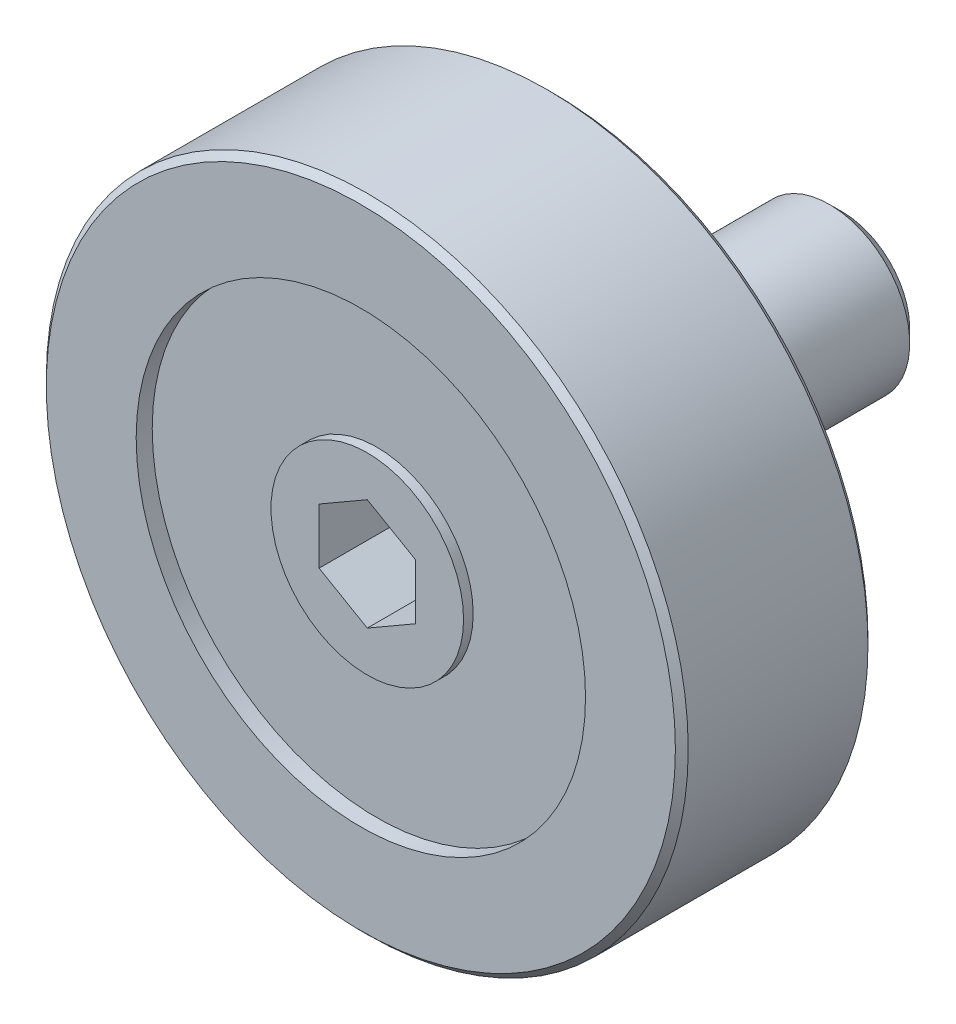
ISO-10303-21;
HEADER;
FILE_DESCRIPTION(('STEP AP214'),'2;1');
FILE_NAME('part.step','',(''),(''),'','','');
FILE_SCHEMA(('AUTOMOTIVE_DESIGN { 1 0 10303 214 1 1 1 1 }'));
ENDSEC;
DATA;
#1=APPLICATION_CONTEXT('core data for automotive mechanical design processes');
#2=APPLICATION_PROTOCOL_DEFINITION('international standard','automotive_design',2000,#1);
#3=PRODUCT_CONTEXT('',#1,'mechanical');
#4=PRODUCT('Part','Part','',(#3));
#5=PRODUCT_RELATED_PRODUCT_CATEGORY('part','',(#4));
#6=PRODUCT_DEFINITION_FORMATION('','',#4);
#7=PRODUCT_DEFINITION_CONTEXT('part definition',#1,'design');
#8=PRODUCT_DEFINITION('design','',#6,#7);
#9=PRODUCT_DEFINITION_SHAPE('','',#8);
#10=(LENGTH_UNIT() NAMED_UNIT(*) SI_UNIT(.MILLI.,.METRE.));
#11=(NAMED_UNIT(*) PLANE_ANGLE_UNIT() SI_UNIT($,.RADIAN.));
#12=(NAMED_UNIT(*) SI_UNIT($,.STERADIAN.) SOLID_ANGLE_UNIT());
#13=UNCERTAINTY_MEASURE_WITH_UNIT(LENGTH_MEASURE(1.E-05),#10,'distance_accuracy_value','');
#14=(GEOMETRIC_REPRESENTATION_CONTEXT(3) GLOBAL_UNCERTAINTY_ASSIGNED_CONTEXT((#13)) GLOBAL_UNIT_ASSIGNED_CONTEXT((#10,
#11,#12)) REPRESENTATION_CONTEXT('',''));
#15=CARTESIAN_POINT('',(0.,0.,0.));
#16=DIRECTION('',(0.,0.,1.));
#17=DIRECTION('',(1.,0.,0.));
#18=AXIS2_PLACEMENT_3D('',#15,#16,#17);
#19=CARTESIAN_POINT('',(0.,4.00000000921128,-5.82734880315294E-09));
#20=DIRECTION('',(0.,0.,1.));
#21=DIRECTION('',(1.,0.,0.));
#22=AXIS2_PLACEMENT_3D('',#19,#20,#21);
#23=PLANE('',#22);
#24=CARTESIAN_POINT('',(0.,9.21126900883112E-09,-5.82734901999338E-09));
#25=DIRECTION('',(0.,0.,1.));
#26=DIRECTION('',(1.,0.,0.));
#27=AXIS2_PLACEMENT_3D('',#24,#25,#26);
#28=CIRCLE('',#27,4.);
#29=CARTESIAN_POINT('',(4.,9.21126900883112E-09,-5.82734901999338E-09));
#30=VERTEX_POINT('',#29);
#31=EDGE_CURVE('E9',#30,#30,#28,.T.);
#32=ORIENTED_EDGE('',*,*,#31,.F.);
#33=EDGE_LOOP('',(#32));
#34=FACE_BOUND('',#33,.T.);
#35=CARTESIAN_POINT('',(0.,9.21126900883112E-09,-5.82734901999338E-09));
#36=DIRECTION('',(0.,0.,-1.));
#37=DIRECTION('',(-1.,0.,0.));
#38=AXIS2_PLACEMENT_3D('',#35,#36,#37);
#39=CIRCLE('',#38,2.);
#40=CARTESIAN_POINT('',(-2.,9.21126900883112E-09,-5.82734901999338E-09));
#41=VERTEX_POINT('',#40);
#42=EDGE_CURVE('E104',#41,#41,#39,.T.);
#43=ORIENTED_EDGE('',*,*,#42,.F.);
#44=EDGE_LOOP('',(#43));
#45=FACE_BOUND('',#44,.T.);
#46=ADVANCED_FACE('F14',(#34,#45),#23,.F.);
#47=CARTESIAN_POINT('',(0.,9.21126900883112E-09,9.99999999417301));
#48=DIRECTION('',(0.,0.,1.));
#49=DIRECTION('',(1.,0.,0.));
#50=AXIS2_PLACEMENT_3D('',#47,#48,#49);
#51=CYLINDRICAL_SURFACE('',#50,4.);
#52=CARTESIAN_POINT('',(0.,9.21126900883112E-09,1.49999999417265));
#53=DIRECTION('',(0.,0.,1.));
#54=DIRECTION('',(1.,0.,0.));
#55=AXIS2_PLACEMENT_3D('',#52,#53,#54);
#56=CIRCLE('',#55,4.);
#57=CARTESIAN_POINT('',(4.,9.21126900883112E-09,1.49999999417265));
#58=VERTEX_POINT('',#57);
#59=EDGE_CURVE('E22',#58,#58,#56,.T.);
#60=ORIENTED_EDGE('',*,*,#59,.F.);
#61=EDGE_LOOP('',(#60));
#62=FACE_BOUND('',#61,.T.);
#63=ORIENTED_EDGE('',*,*,#31,.T.);
#64=EDGE_LOOP('',(#63));
#65=FACE_BOUND('',#64,.T.);
#66=ADVANCED_FACE('F156',(#62,#65),#51,.T.);
#67=CARTESIAN_POINT('',(0.,4.00000000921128,1.49999999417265));
#68=DIRECTION('',(0.,0.,1.));
#69=DIRECTION('',(1.,0.,0.));
#70=AXIS2_PLACEMENT_3D('',#67,#68,#69);
#71=PLANE('',#70);
#72=CARTESIAN_POINT('',(0.,9.21126900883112E-09,1.49999999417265));
#73=DIRECTION('',(0.,0.,1.));
#74=DIRECTION('',(1.,0.,0.));
#75=AXIS2_PLACEMENT_3D('',#72,#73,#74);
#76=CIRCLE('',#75,6.99999999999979);
#77=CARTESIAN_POINT('',(6.99999999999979,9.21126900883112E-09,1.49999999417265));
#78=VERTEX_POINT('',#77);
#79=EDGE_CURVE('E149',#78,#78,#76,.T.);
#80=ORIENTED_EDGE('',*,*,#79,.F.);
#81=EDGE_LOOP('',(#80));
#82=FACE_BOUND('',#81,.T.);
#83=ORIENTED_EDGE('',*,*,#59,.T.);
#84=EDGE_LOOP('',(#83));
#85=FACE_BOUND('',#84,.T.);
#86=ADVANCED_FACE('F154',(#82,#85),#71,.F.);
#87=CARTESIAN_POINT('',(0.,9.21126900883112E-09,9.99999999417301));
#88=DIRECTION('',(0.,0.,1.));
#89=DIRECTION('',(1.,0.,0.));
#90=AXIS2_PLACEMENT_3D('',#87,#88,#89);
#91=CYLINDRICAL_SURFACE('',#90,6.99999999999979);
#92=CARTESIAN_POINT('',(0.,9.21126900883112E-09,0.999999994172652));
#93=DIRECTION('',(0.,0.,1.));
#94=DIRECTION('',(1.,0.,0.));
#95=AXIS2_PLACEMENT_3D('',#92,#93,#94);
#96=CIRCLE('',#95,6.99999999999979);
#97=CARTESIAN_POINT('',(6.99999999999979,9.21126900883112E-09,0.999999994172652));
#98=VERTEX_POINT('',#97);
#99=EDGE_CURVE('E146',#98,#98,#96,.T.);
#100=ORIENTED_EDGE('',*,*,#99,.F.);
#101=EDGE_LOOP('',(#100));
#102=FACE_BOUND('',#101,.T.);
#103=ORIENTED_EDGE('',*,*,#79,.T.);
#104=EDGE_LOOP('',(#103));
#105=FACE_BOUND('',#104,.T.);
#106=ADVANCED_FACE('F237',(#102,#105),#91,.F.);
#107=CARTESIAN_POINT('',(0.,9.80000000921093,0.999999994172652));
#108=DIRECTION('',(0.,0.,1.));
#109=DIRECTION('',(1.,0.,0.));
#110=AXIS2_PLACEMENT_3D('',#107,#108,#109);
#111=PLANE('',#110);
#112=CARTESIAN_POINT('',(0.,9.21126900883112E-09,0.999999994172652));
#113=DIRECTION('',(0.,0.,1.));
#114=DIRECTION('',(1.,0.,0.));
#115=AXIS2_PLACEMENT_3D('',#112,#113,#114);
#116=CIRCLE('',#115,9.79999999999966);
#117=CARTESIAN_POINT('',(9.79999999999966,9.21126900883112E-09,0.999999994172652));
#118=VERTEX_POINT('',#117);
#119=EDGE_CURVE('E143',#118,#118,#116,.T.);
#120=ORIENTED_EDGE('',*,*,#119,.F.);
#121=EDGE_LOOP('',(#120));
#122=FACE_BOUND('',#121,.T.);
#123=ORIENTED_EDGE('',*,*,#99,.T.);
#124=EDGE_LOOP('',(#123));
#125=FACE_BOUND('',#124,.T.);
#126=ADVANCED_FACE('F233',(#122,#125),#111,.F.);
#127=CARTESIAN_POINT('',(0.,9.21126900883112E-09,0.999999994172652));
#128=DIRECTION('',(0.,0.,1.));
#129=DIRECTION('',(1.,0.,0.));
#130=AXIS2_PLACEMENT_3D('',#127,#128,#129);
#131=CONICAL_SURFACE('',#130,9.79999999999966,0.785398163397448);
#132=CARTESIAN_POINT('',(0.,9.21126900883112E-09,1.19999999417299));
#133=DIRECTION('',(0.,0.,1.));
#134=DIRECTION('',(1.,0.,0.));
#135=AXIS2_PLACEMENT_3D('',#132,#133,#134);
#136=CIRCLE('',#135,10.);
#137=CARTESIAN_POINT('',(10.,9.21126900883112E-09,1.19999999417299));
#138=VERTEX_POINT('',#137);
#139=EDGE_CURVE('E140',#138,#138,#136,.T.);
#140=ORIENTED_EDGE('',*,*,#139,.F.);
#141=EDGE_LOOP('',(#140));
#142=FACE_BOUND('',#141,.T.);
#143=ORIENTED_EDGE('',*,*,#119,.T.);
#144=EDGE_LOOP('',(#143));
#145=FACE_BOUND('',#144,.T.);
#146=ADVANCED_FACE('F229',(#142,#145),#131,.T.);
#147=CARTESIAN_POINT('',(0.,9.21126900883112E-09,9.99999999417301));
#148=DIRECTION('',(0.,0.,1.));
#149=DIRECTION('',(1.,0.,0.));
#150=AXIS2_PLACEMENT_3D('',#147,#148,#149);
#151=CYLINDRICAL_SURFACE('',#150,10.);
#152=CARTESIAN_POINT('',(0.,9.21126900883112E-09,6.79999999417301));
#153=DIRECTION('',(0.,0.,1.));
#154=DIRECTION('',(1.,0.,0.));
#155=AXIS2_PLACEMENT_3D('',#152,#153,#154);
#156=CIRCLE('',#155,10.);
#157=CARTESIAN_POINT('',(10.,9.21126900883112E-09,6.79999999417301));
#158=VERTEX_POINT('',#157);
#159=EDGE_CURVE('E137',#158,#158,#156,.T.);
#160=ORIENTED_EDGE('',*,*,#159,.F.);
#161=EDGE_LOOP('',(#160));
#162=FACE_BOUND('',#161,.T.);
#163=ORIENTED_EDGE('',*,*,#139,.T.);
#164=EDGE_LOOP('',(#163));
#165=FACE_BOUND('',#164,.T.);
#166=ADVANCED_FACE('F225',(#162,#165),#151,.T.);
#167=CARTESIAN_POINT('',(0.,9.21126900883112E-09,6.79999999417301));
#168=DIRECTION('',(0.,0.,-1.));
#169=DIRECTION('',(-1.,0.,0.));
#170=AXIS2_PLACEMENT_3D('',#167,#168,#169);
#171=CONICAL_SURFACE('',#170,10.,0.785398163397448);
#172=CARTESIAN_POINT('',(0.,9.21126900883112E-09,6.999999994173));
#173=DIRECTION('',(0.,0.,1.));
#174=DIRECTION('',(1.,0.,0.));
#175=AXIS2_PLACEMENT_3D('',#172,#173,#174);
#176=CIRCLE('',#175,9.8);
#177=CARTESIAN_POINT('',(9.8,9.21126900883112E-09,6.999999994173));
#178=VERTEX_POINT('',#177);
#179=EDGE_CURVE('E134',#178,#178,#176,.T.);
#180=ORIENTED_EDGE('',*,*,#179,.F.);
#181=EDGE_LOOP('',(#180));
#182=FACE_BOUND('',#181,.T.);
#183=ORIENTED_EDGE('',*,*,#159,.T.);
#184=EDGE_LOOP('',(#183));
#185=FACE_BOUND('',#184,.T.);
#186=ADVANCED_FACE('F221',(#182,#185),#171,.T.);
#187=CARTESIAN_POINT('',(0.,9.80000000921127,6.999999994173));
#188=DIRECTION('',(0.,0.,-1.));
#189=DIRECTION('',(-1.,0.,0.));
#190=AXIS2_PLACEMENT_3D('',#187,#188,#189);
#191=PLANE('',#190);
#192=CARTESIAN_POINT('',(0.,9.21126900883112E-09,6.999999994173));
#193=DIRECTION('',(0.,0.,1.));
#194=DIRECTION('',(1.,0.,0.));
#195=AXIS2_PLACEMENT_3D('',#192,#193,#194);
#196=CIRCLE('',#195,7.);
#197=CARTESIAN_POINT('',(7.,9.21126900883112E-09,6.999999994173));
#198=VERTEX_POINT('',#197);
#199=EDGE_CURVE('E131',#198,#198,#196,.T.);
#200=ORIENTED_EDGE('',*,*,#199,.F.);
#201=EDGE_LOOP('',(#200));
#202=FACE_BOUND('',#201,.T.);
#203=ORIENTED_EDGE('',*,*,#179,.T.);
#204=EDGE_LOOP('',(#203));
#205=FACE_BOUND('',#204,.T.);
#206=ADVANCED_FACE('F217',(#202,#205),#191,.F.);
#207=CARTESIAN_POINT('',(0.,9.21126900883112E-09,9.99999999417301));
#208=DIRECTION('',(0.,0.,1.));
#209=DIRECTION('',(1.,0.,0.));
#210=AXIS2_PLACEMENT_3D('',#207,#208,#209);
#211=CYLINDRICAL_SURFACE('',#210,7.);
#212=CARTESIAN_POINT('',(0.,9.21126900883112E-09,6.499999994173));
#213=DIRECTION('',(0.,0.,1.));
#214=DIRECTION('',(1.,0.,0.));
#215=AXIS2_PLACEMENT_3D('',#212,#213,#214);
#216=CIRCLE('',#215,7.);
#217=CARTESIAN_POINT('',(7.,9.21126900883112E-09,6.499999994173));
#218=VERTEX_POINT('',#217);
#219=EDGE_CURVE('E128',#218,#218,#216,.T.);
#220=ORIENTED_EDGE('',*,*,#219,.F.);
#221=EDGE_LOOP('',(#220));
#222=FACE_BOUND('',#221,.T.);
#223=ORIENTED_EDGE('',*,*,#199,.T.);
#224=EDGE_LOOP('',(#223));
#225=FACE_BOUND('',#224,.T.);
#226=ADVANCED_FACE('F213',(#222,#225),#211,.F.);
#227=CARTESIAN_POINT('',(0.,3.00000000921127,6.499999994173));
#228=DIRECTION('',(0.,0.,-1.));
#229=DIRECTION('',(-1.,0.,0.));
#230=AXIS2_PLACEMENT_3D('',#227,#228,#229);
#231=PLANE('',#230);
#232=CARTESIAN_POINT('',(0.,9.21126900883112E-09,6.499999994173));
#233=DIRECTION('',(0.,0.,1.));
#234=DIRECTION('',(1.,0.,0.));
#235=AXIS2_PLACEMENT_3D('',#232,#233,#234);
#236=CIRCLE('',#235,3.);
#237=CARTESIAN_POINT('',(3.,9.21126900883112E-09,6.499999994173));
#238=VERTEX_POINT('',#237);
#239=EDGE_CURVE('E125',#238,#238,#236,.T.);
#240=ORIENTED_EDGE('',*,*,#239,.F.);
#241=EDGE_LOOP('',(#240));
#242=FACE_BOUND('',#241,.T.);
#243=ORIENTED_EDGE('',*,*,#219,.T.);
#244=EDGE_LOOP('',(#243));
#245=FACE_BOUND('',#244,.T.);
#246=ADVANCED_FACE('F209',(#242,#245),#231,.F.);
#247=CARTESIAN_POINT('',(0.,9.21126900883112E-09,9.99999999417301));
#248=DIRECTION('',(0.,0.,1.));
#249=DIRECTION('',(1.,0.,0.));
#250=AXIS2_PLACEMENT_3D('',#247,#248,#249);
#251=CYLINDRICAL_SURFACE('',#250,3.);
#252=CARTESIAN_POINT('',(0.,9.21126900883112E-09,6.79999999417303));
#253=DIRECTION('',(0.,0.,1.));
#254=DIRECTION('',(1.,0.,0.));
#255=AXIS2_PLACEMENT_3D('',#252,#253,#254);
#256=CIRCLE('',#255,3.);
#257=CARTESIAN_POINT('',(3.,9.21126900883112E-09,6.79999999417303));
#258=VERTEX_POINT('',#257);
#259=EDGE_CURVE('E117',#258,#258,#256,.T.);
#260=ORIENTED_EDGE('',*,*,#259,.F.);
#261=EDGE_LOOP('',(#260));
#262=FACE_BOUND('',#261,.T.);
#263=ORIENTED_EDGE('',*,*,#239,.T.);
#264=EDGE_LOOP('',(#263));
#265=FACE_BOUND('',#264,.T.);
#266=ADVANCED_FACE('F206',(#262,#265),#251,.T.);
#267=CARTESIAN_POINT('',(0.,3.00000000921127,6.79999999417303));
#268=DIRECTION('',(0.,0.,-1.));
#269=DIRECTION('',(-1.,0.,0.));
#270=AXIS2_PLACEMENT_3D('',#267,#268,#269);
#271=PLANE('',#270);
#272=DIRECTION('',(-0.866025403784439,-0.5,0.));
#273=VECTOR('',#272,1.);
#274=CARTESIAN_POINT('',(0.,1.73205080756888,6.79999999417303));
#275=LINE('',#274,#273);
#276=CARTESIAN_POINT('',(0.,1.73205080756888,6.79999999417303));
#277=VERTEX_POINT('',#276);
#278=CARTESIAN_POINT('',(-1.5,0.866025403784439,6.79999999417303));
#279=VERTEX_POINT('',#278);
#280=EDGE_CURVE('E103',#277,#279,#275,.T.);
#281=ORIENTED_EDGE('',*,*,#280,.F.);
#282=DIRECTION('',(-0.866025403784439,0.5,0.));
#283=VECTOR('',#282,1.);
#284=CARTESIAN_POINT('',(1.5,0.866025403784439,6.79999999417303));
#285=LINE('',#284,#283);
#286=CARTESIAN_POINT('',(1.5,0.866025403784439,6.79999999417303));
#287=VERTEX_POINT('',#286);
#288=EDGE_CURVE('E29',#287,#277,#285,.T.);
#289=ORIENTED_EDGE('',*,*,#288,.F.);
#290=DIRECTION('',(0.,1.,0.));
#291=VECTOR('',#290,1.);
#292=CARTESIAN_POINT('',(1.5,-0.866025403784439,6.79999999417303));
#293=LINE('',#292,#291);
#294=CARTESIAN_POINT('',(1.5,-0.866025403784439,6.79999999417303));
#295=VERTEX_POINT('',#294);
#296=EDGE_CURVE('E113',#295,#287,#293,.T.);
#297=ORIENTED_EDGE('',*,*,#296,.F.);
#298=DIRECTION('',(0.866025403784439,0.5,0.));
#299=VECTOR('',#298,1.);
#300=CARTESIAN_POINT('',(0.,-1.73205080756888,6.79999999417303));
#301=LINE('',#300,#299);
#302=CARTESIAN_POINT('',(0.,-1.73205080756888,6.79999999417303));
#303=VERTEX_POINT('',#302);
#304=EDGE_CURVE('E111',#303,#295,#301,.T.);
#305=ORIENTED_EDGE('',*,*,#304,.F.);
#306=DIRECTION('',(0.866025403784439,-0.5,0.));
#307=VECTOR('',#306,1.);
#308=CARTESIAN_POINT('',(-1.5,-0.866025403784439,6.79999999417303));
#309=LINE('',#308,#307);
#310=CARTESIAN_POINT('',(-1.5,-0.866025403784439,6.79999999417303));
#311=VERTEX_POINT('',#310);
#312=EDGE_CURVE('E77',#311,#303,#309,.T.);
#313=ORIENTED_EDGE('',*,*,#312,.F.);
#314=DIRECTION('',(0.,-1.,0.));
#315=VECTOR('',#314,1.);
#316=CARTESIAN_POINT('',(-1.5,0.866025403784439,6.79999999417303));
#317=LINE('',#316,#315);
#318=EDGE_CURVE('E107',#279,#311,#317,.T.);
#319=ORIENTED_EDGE('',*,*,#318,.F.);
#320=EDGE_LOOP('',(#281,#289,#297,#305,#313,#319));
#321=FACE_BOUND('',#320,.T.);
#322=ORIENTED_EDGE('',*,*,#259,.T.);
#323=EDGE_LOOP('',(#322));
#324=FACE_BOUND('',#323,.T.);
#325=ADVANCED_FACE('F181',(#321,#324),#271,.F.);
#326=CARTESIAN_POINT('',(1.5,0.866025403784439,4.29999999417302));
#327=DIRECTION('',(0.5,0.866025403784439,0.));
#328=DIRECTION('',(-0.866025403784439,0.5,0.));
#329=AXIS2_PLACEMENT_3D('',#326,#327,#328);
#330=PLANE('',#329);
#331=ORIENTED_EDGE('',*,*,#288,.T.);
#332=DIRECTION('',(0.,0.,1.));
#333=VECTOR('',#332,1.);
#334=CARTESIAN_POINT('',(0.,1.73205080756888,4.29999999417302));
#335=LINE('',#334,#333);
#336=CARTESIAN_POINT('',(0.,1.73205080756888,4.29999999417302));
#337=VERTEX_POINT('',#336);
#338=EDGE_CURVE('E59',#337,#277,#335,.T.);
#339=ORIENTED_EDGE('',*,*,#338,.F.);
#340=DIRECTION('',(-0.866025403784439,0.5,0.));
#341=VECTOR('',#340,1.);
#342=CARTESIAN_POINT('',(1.5,0.866025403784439,4.29999999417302));
#343=LINE('',#342,#341);
#344=CARTESIAN_POINT('',(1.5,0.866025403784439,4.29999999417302));
#345=VERTEX_POINT('',#344);
#346=EDGE_CURVE('E115',#345,#337,#343,.T.);
#347=ORIENTED_EDGE('',*,*,#346,.F.);
#348=DIRECTION('',(0.,0.,1.));
#349=VECTOR('',#348,1.);
#350=CARTESIAN_POINT('',(1.5,0.866025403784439,4.29999999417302));
#351=LINE('',#350,#349);
#352=EDGE_CURVE('E37',#345,#287,#351,.T.);
#353=ORIENTED_EDGE('',*,*,#352,.T.);
#354=EDGE_LOOP('',(#331,#339,#347,#353));
#355=FACE_BOUND('',#354,.T.);
#356=ADVANCED_FACE('F186',(#355),#330,.F.);
#357=CARTESIAN_POINT('',(1.5,-0.866025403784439,4.29999999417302));
#358=DIRECTION('',(1.,0.,0.));
#359=DIRECTION('',(0.,0.,-1.));
#360=AXIS2_PLACEMENT_3D('',#357,#358,#359);
#361=PLANE('',#360);
#362=ORIENTED_EDGE('',*,*,#296,.T.);
#363=ORIENTED_EDGE('',*,*,#352,.F.);
#364=DIRECTION('',(0.,1.,0.));
#365=VECTOR('',#364,1.);
#366=CARTESIAN_POINT('',(1.5,-0.866025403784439,4.29999999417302));
#367=LINE('',#366,#365);
#368=CARTESIAN_POINT('',(1.5,-0.866025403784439,4.29999999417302));
#369=VERTEX_POINT('',#368);
#370=EDGE_CURVE('E89',#369,#345,#367,.T.);
#371=ORIENTED_EDGE('',*,*,#370,.F.);
#372=DIRECTION('',(0.,0.,1.));
#373=VECTOR('',#372,1.);
#374=CARTESIAN_POINT('',(1.5,-0.866025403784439,4.29999999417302));
#375=LINE('',#374,#373);
#376=EDGE_CURVE('E81',#369,#295,#375,.T.);
#377=ORIENTED_EDGE('',*,*,#376,.T.);
#378=EDGE_LOOP('',(#362,#363,#371,#377));
#379=FACE_BOUND('',#378,.T.);
#380=ADVANCED_FACE('F184',(#379),#361,.F.);
#381=CARTESIAN_POINT('',(0.,-1.73205080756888,4.29999999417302));
#382=DIRECTION('',(0.5,-0.866025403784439,0.));
#383=DIRECTION('',(0.866025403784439,0.5,0.));
#384=AXIS2_PLACEMENT_3D('',#381,#382,#383);
#385=PLANE('',#384);
#386=ORIENTED_EDGE('',*,*,#304,.T.);
#387=ORIENTED_EDGE('',*,*,#376,.F.);
#388=DIRECTION('',(0.866025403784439,0.5,0.));
#389=VECTOR('',#388,1.);
#390=CARTESIAN_POINT('',(0.,-1.73205080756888,4.29999999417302));
#391=LINE('',#390,#389);
#392=CARTESIAN_POINT('',(0.,-1.73205080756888,4.29999999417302));
#393=VERTEX_POINT('',#392);
#394=EDGE_CURVE('E85',#393,#369,#391,.T.);
#395=ORIENTED_EDGE('',*,*,#394,.F.);
#396=DIRECTION('',(0.,0.,1.));
#397=VECTOR('',#396,1.);
#398=CARTESIAN_POINT('',(0.,-1.73205080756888,4.29999999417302));
#399=LINE('',#398,#397);
#400=EDGE_CURVE('E70',#393,#303,#399,.T.);
#401=ORIENTED_EDGE('',*,*,#400,.T.);
#402=EDGE_LOOP('',(#386,#387,#395,#401));
#403=FACE_BOUND('',#402,.T.);
#404=ADVANCED_FACE('F86',(#403),#385,.F.);
#405=CARTESIAN_POINT('',(-1.5,-0.866025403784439,4.29999999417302));
#406=DIRECTION('',(-0.5,-0.866025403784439,0.));
#407=DIRECTION('',(0.866025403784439,-0.5,0.));
#408=AXIS2_PLACEMENT_3D('',#405,#406,#407);
#409=PLANE('',#408);
#410=ORIENTED_EDGE('',*,*,#312,.T.);
#411=ORIENTED_EDGE('',*,*,#400,.F.);
#412=DIRECTION('',(0.866025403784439,-0.5,0.));
#413=VECTOR('',#412,1.);
#414=CARTESIAN_POINT('',(-1.5,-0.866025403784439,4.29999999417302));
#415=LINE('',#414,#413);
#416=CARTESIAN_POINT('',(-1.5,-0.866025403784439,4.29999999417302));
#417=VERTEX_POINT('',#416);
#418=EDGE_CURVE('E74',#417,#393,#415,.T.);
#419=ORIENTED_EDGE('',*,*,#418,.F.);
#420=DIRECTION('',(0.,0.,1.));
#421=VECTOR('',#420,1.);
#422=CARTESIAN_POINT('',(-1.5,-0.866025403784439,4.29999999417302));
#423=LINE('',#422,#421);
#424=EDGE_CURVE('E82',#417,#311,#423,.T.);
#425=ORIENTED_EDGE('',*,*,#424,.T.);
#426=EDGE_LOOP('',(#410,#411,#419,#425));
#427=FACE_BOUND('',#426,.T.);
#428=ADVANCED_FACE('F72',(#427),#409,.F.);
#429=CARTESIAN_POINT('',(-1.5,0.866025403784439,4.29999999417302));
#430=DIRECTION('',(-1.,0.,0.));
#431=DIRECTION('',(0.,-1.,0.));
#432=AXIS2_PLACEMENT_3D('',#429,#430,#431);
#433=PLANE('',#432);
#434=ORIENTED_EDGE('',*,*,#318,.T.);
#435=ORIENTED_EDGE('',*,*,#424,.F.);
#436=DIRECTION('',(0.,-1.,0.));
#437=VECTOR('',#436,1.);
#438=CARTESIAN_POINT('',(-1.5,0.866025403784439,4.29999999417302));
#439=LINE('',#438,#437);
#440=CARTESIAN_POINT('',(-1.5,0.866025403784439,4.29999999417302));
#441=VERTEX_POINT('',#440);
#442=EDGE_CURVE('E95',#441,#417,#439,.T.);
#443=ORIENTED_EDGE('',*,*,#442,.F.);
#444=DIRECTION('',(0.,0.,1.));
#445=VECTOR('',#444,1.);
#446=CARTESIAN_POINT('',(-1.5,0.866025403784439,4.29999999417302));
#447=LINE('',#446,#445);
#448=EDGE_CURVE('E120',#441,#279,#447,.T.);
#449=ORIENTED_EDGE('',*,*,#448,.T.);
#450=EDGE_LOOP('',(#434,#435,#443,#449));
#451=FACE_BOUND('',#450,.T.);
#452=ADVANCED_FACE('F179',(#451),#433,.F.);
#453=CARTESIAN_POINT('',(0.,1.73205080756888,4.29999999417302));
#454=DIRECTION('',(-0.5,0.866025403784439,0.));
#455=DIRECTION('',(-0.866025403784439,-0.5,0.));
#456=AXIS2_PLACEMENT_3D('',#453,#454,#455);
#457=PLANE('',#456);
#458=ORIENTED_EDGE('',*,*,#280,.T.);
#459=ORIENTED_EDGE('',*,*,#448,.F.);
#460=DIRECTION('',(-0.866025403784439,-0.5,0.));
#461=VECTOR('',#460,1.);
#462=CARTESIAN_POINT('',(0.,1.73205080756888,4.29999999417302));
#463=LINE('',#462,#461);
#464=EDGE_CURVE('E97',#337,#441,#463,.T.);
#465=ORIENTED_EDGE('',*,*,#464,.F.);
#466=ORIENTED_EDGE('',*,*,#338,.T.);
#467=EDGE_LOOP('',(#458,#459,#465,#466));
#468=FACE_BOUND('',#467,.T.);
#469=ADVANCED_FACE('F175',(#468),#457,.F.);
#470=CARTESIAN_POINT('',(0.,0.,4.29999999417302));
#471=DIRECTION('',(0.,0.,1.));
#472=DIRECTION('',(1.,0.,0.));
#473=AXIS2_PLACEMENT_3D('',#470,#471,#472);
#474=PLANE('',#473);
#475=ORIENTED_EDGE('',*,*,#346,.T.);
#476=ORIENTED_EDGE('',*,*,#464,.T.);
#477=ORIENTED_EDGE('',*,*,#442,.T.);
#478=ORIENTED_EDGE('',*,*,#418,.T.);
#479=ORIENTED_EDGE('',*,*,#394,.T.);
#480=ORIENTED_EDGE('',*,*,#370,.T.);
#481=EDGE_LOOP('',(#475,#476,#477,#478,#479,#480));
#482=FACE_BOUND('',#481,.T.);
#483=ADVANCED_FACE('F92',(#482),#474,.T.);
#484=CARTESIAN_POINT('',(0.,9.21126900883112E-09,-8.00000000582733));
#485=DIRECTION('',(0.,0.,-1.));
#486=DIRECTION('',(-1.,0.,0.));
#487=AXIS2_PLACEMENT_3D('',#484,#485,#486);
#488=CYLINDRICAL_SURFACE('',#487,2.);
#489=CARTESIAN_POINT('',(0.,9.21126900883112E-09,-1.60000000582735));
#490=DIRECTION('',(0.,0.,-1.));
#491=DIRECTION('',(-1.,0.,0.));
#492=AXIS2_PLACEMENT_3D('',#489,#490,#491);
#493=CIRCLE('',#492,2.);
#494=CARTESIAN_POINT('',(-2.,9.21126900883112E-09,-1.60000000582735));
#495=VERTEX_POINT('',#494);
#496=EDGE_CURVE('E167',#495,#495,#493,.T.);
#497=ORIENTED_EDGE('',*,*,#496,.F.);
#498=EDGE_LOOP('',(#497));
#499=FACE_BOUND('',#498,.T.);
#500=ORIENTED_EDGE('',*,*,#42,.T.);
#501=EDGE_LOOP('',(#500));
#502=FACE_BOUND('',#501,.T.);
#503=ADVANCED_FACE('F349',(#499,#502),#488,.T.);
#504=CARTESIAN_POINT('',(0.,2.00000000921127,-1.60000000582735));
#505=DIRECTION('',(0.,0.,-1.));
#506=DIRECTION('',(-1.,0.,0.));
#507=AXIS2_PLACEMENT_3D('',#504,#505,#506);
#508=PLANE('',#507);
#509=CARTESIAN_POINT('',(0.,9.21126900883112E-09,-1.60000000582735));
#510=DIRECTION('',(0.,0.,-1.));
#511=DIRECTION('',(-1.,0.,0.));
#512=AXIS2_PLACEMENT_3D('',#509,#510,#511);
#513=CIRCLE('',#512,2.5);
#514=CARTESIAN_POINT('',(-2.5,9.21126900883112E-09,-1.60000000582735));
#515=VERTEX_POINT('',#514);
#516=EDGE_CURVE('E170',#515,#515,#513,.T.);
#517=ORIENTED_EDGE('',*,*,#516,.F.);
#518=EDGE_LOOP('',(#517));
#519=FACE_BOUND('',#518,.T.);
#520=ORIENTED_EDGE('',*,*,#496,.T.);
#521=EDGE_LOOP('',(#520));
#522=FACE_BOUND('',#521,.T.);
#523=ADVANCED_FACE('F358',(#519,#522),#508,.F.);
#524=CARTESIAN_POINT('',(0.,9.21126900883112E-09,-8.00000000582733));
#525=DIRECTION('',(0.,0.,-1.));
#526=DIRECTION('',(-1.,0.,0.));
#527=AXIS2_PLACEMENT_3D('',#524,#525,#526);
#528=CYLINDRICAL_SURFACE('',#527,2.5);
#529=CARTESIAN_POINT('',(0.,9.21126900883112E-09,-7.60000000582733));
#530=DIRECTION('',(0.,0.,-1.));
#531=DIRECTION('',(-1.,0.,0.));
#532=AXIS2_PLACEMENT_3D('',#529,#530,#531);
#533=CIRCLE('',#532,2.5);
#534=CARTESIAN_POINT('',(-2.5,9.21126900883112E-09,-7.60000000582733));
#535=VERTEX_POINT('',#534);
#536=EDGE_CURVE('E402',#535,#535,#533,.T.);
#537=ORIENTED_EDGE('',*,*,#536,.F.);
#538=EDGE_LOOP('',(#537));
#539=FACE_BOUND('',#538,.T.);
#540=ORIENTED_EDGE('',*,*,#516,.T.);
#541=EDGE_LOOP('',(#540));
#542=FACE_BOUND('',#541,.T.);
#543=ADVANCED_FACE('F367',(#539,#542),#528,.T.);
#544=CARTESIAN_POINT('',(0.,9.21126900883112E-09,-7.60000000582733));
#545=DIRECTION('',(0.,0.,1.));
#546=DIRECTION('',(1.,0.,0.));
#547=AXIS2_PLACEMENT_3D('',#544,#545,#546);
#548=CONICAL_SURFACE('',#547,2.5,0.785398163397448);
#549=CARTESIAN_POINT('',(0.,9.21126900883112E-09,-8.00000000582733));
#550=DIRECTION('',(0.,0.,-1.));
#551=DIRECTION('',(-1.,0.,0.));
#552=AXIS2_PLACEMENT_3D('',#549,#550,#551);
#553=CIRCLE('',#552,2.1);
#554=CARTESIAN_POINT('',(-2.1,9.21126900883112E-09,-8.00000000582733));
#555=VERTEX_POINT('',#554);
#556=EDGE_CURVE('E401',#555,#555,#553,.T.);
#557=ORIENTED_EDGE('',*,*,#556,.F.);
#558=EDGE_LOOP('',(#557));
#559=FACE_BOUND('',#558,.T.);
#560=ORIENTED_EDGE('',*,*,#536,.T.);
#561=EDGE_LOOP('',(#560));
#562=FACE_BOUND('',#561,.T.);
#563=ADVANCED_FACE('F377',(#559,#562),#548,.T.);
#564=CARTESIAN_POINT('',(0.,9.21126900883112E-09,-8.00000000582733));
#565=DIRECTION('',(0.,0.,1.));
#566=DIRECTION('',(1.,0.,0.));
#567=AXIS2_PLACEMENT_3D('',#564,#565,#566);
#568=PLANE('',#567);
#569=ORIENTED_EDGE('',*,*,#556,.T.);
#570=EDGE_LOOP('',(#569));
#571=FACE_BOUND('',#570,.T.);
#572=ADVANCED_FACE('F16',(#571),#568,.F.);
#573=CLOSED_SHELL('',(#46,#66,#86,#106,#126,#146,#166,#186,#206,#226,#246,#266,#325,#356,#380,
#404,#428,#452,#469,#483,#503,#523,#543,#563,#572));
#574=MANIFOLD_SOLID_BREP('B1',#573);
#575=ADVANCED_BREP_SHAPE_REPRESENTATION('',(#18,#574),#14);
#576=SHAPE_DEFINITION_REPRESENTATION(#9,#575);
ENDSEC;
END-ISO-10303-21;
